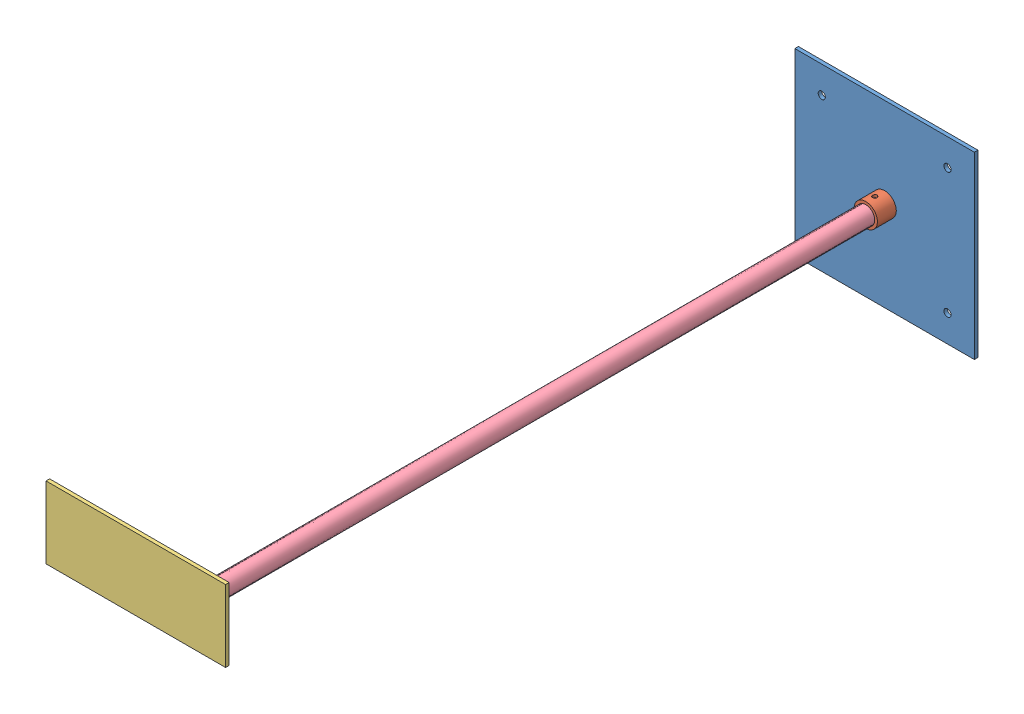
SolidWorks assembly ANCRAGE S5.SLDASM, configuration Défaut (file format 3100). Lengths in mm.
Overall size (260 200 778).
7 component instances, 4 part files, 5 mates.
Components (placement in the parent):
- Ancrage-1: Ancrage.SLDASM [Défaut] at origin size (200 200 25)
  - Plaque d'ancrage-1: Plaque d'ancrage.SLDPRT [Défaut] at (-120.6874 -104.7826 0) size (200 200 4)
  - Tube d'ancrage-1: Tube d'ancrage.SLDPRT [Défaut] at (-20.6874 -4.7826 4) size (26 26 21)
- Ancrage SUPERIEUR-1: Ancrage SUPERIEUR.SLDASM [Défaut] at (-60 -69.5651 778) x (1 0 0) z (0 0 -1) size (200 80 25)
  - Plaque d'ancrage SUPERIEURE-1: Plaque d'ancrage SUPERIEURE.SLDPRT [Défaut] at (-120.6874 -104.7826 0) size (200 80 4)
  - Tube d'ancrage-1: Tube d'ancrage.SLDPRT [Défaut] at (39.3126 -64.7826 4) size (26 26 21)
- Axe pivot-1: Axe pivot.SLDPRT [Défaut] at (-20.6874 -4.7826 4) x (0.425069 0.905161 0) z (0 0 1) size (20 20 770)
Mates (geometry in assembly coordinates):
- Coaxiale2: concentric aligned: cylinder of Ancrage-1/Tube d'ancrage-1; cylinder of Axe pivot-1
- Coaxiale3: concentric anti-aligned: cylinder of ?; cylinder of Axe pivot-1
- Coïncidente1: coincident anti-aligned: plane of Ancrage-1/Plaque d'ancrage-1 through (-120.6874 95.2174 4) normal (0 0 1); plane of Axe pivot-1 through (-20.6874 -4.7826 4) normal (0 0 -1)
- Coïncidente2: coincident anti-aligned: plane of ? through (-163.0135 -88.1088 774) normal (0 0 -1); plane of Axe pivot-1 through (-20.6874 -4.7826 774) normal (0 0 1)
- Parallèle1: parallel anti-aligned: plane of ?; plane of assembly
